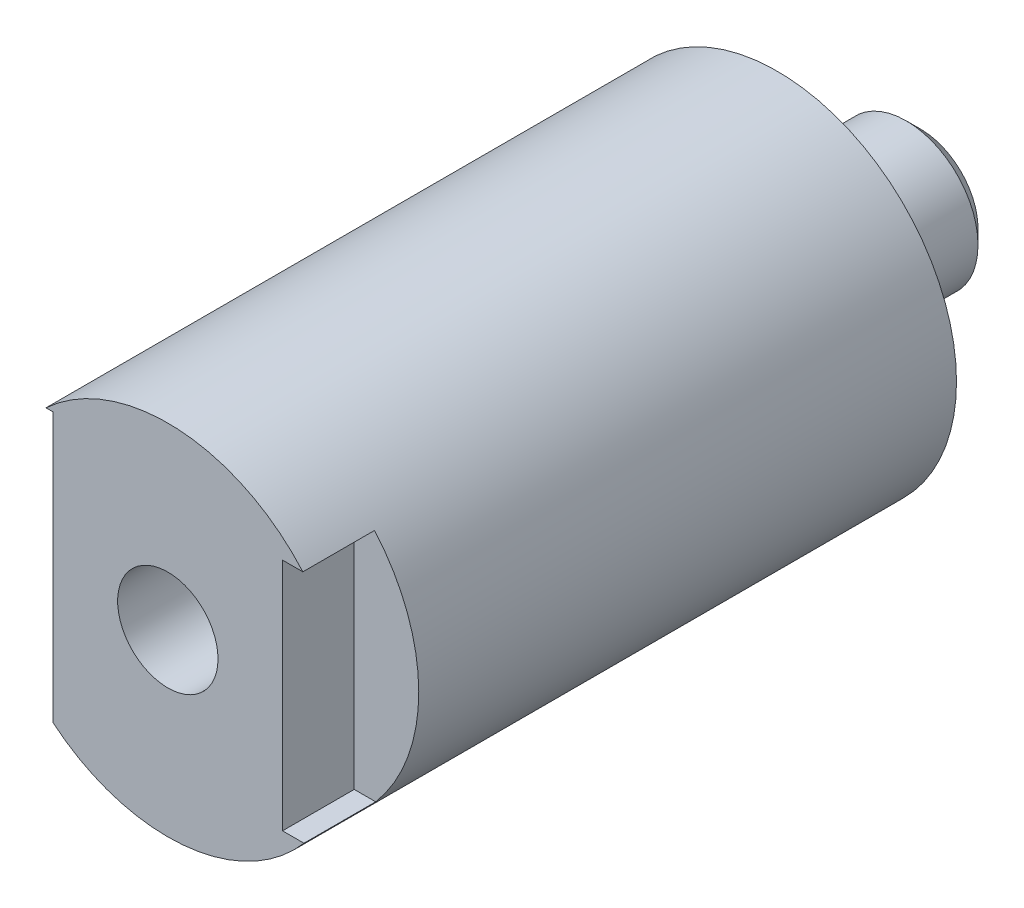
from build123d import *

# Parameters (mm, degrees)
ESQUISSE1_R                = 25
BASE_EXTRUSION_DEPTH       = 85
ESQUISSE3_W                = 12.737127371
ESQUISSE3_H                = 32.700993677
ESQUISSE3_W_2              = 12.375790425
ESQUISSE3_H_2              = 37.579042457
ENL_V_MAT_EXTRU_2_DEPTH    = 10
ESQUISSE4_R                = 10
BOSS_EXTRU_1_DEPTH         = 20
CHANFREIN1_SIZE            = 2
TROU_TARAUD_M16X2_01_D     = 14
TROU_TARAUD_M16X2_01_DEPTH = 30
TROU_TARAUD_M16X2_01_TIP   = 4.206024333


with BuildPart() as part:
    # Esquisse1 → Base-Extrusion (new body)
    with BuildSketch(Plane.XY):
        Circle(ESQUISSE1_R)
    extrude(amount=BASE_EXTRUSION_DEPTH)

    # Esquisse3 → Enl_v. mat.-Extru.2 (cut)
    with BuildSketch(Plane.XY.offset(85)):
        with Locations((22.368563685, 0.090334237)):
            Rectangle(ESQUISSE3_W, ESQUISSE3_H)
        with Locations((-22.187895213, -0.451671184)):
            Rectangle(ESQUISSE3_W_2, ESQUISSE3_H_2)
    extrude(amount=-ENL_V_MAT_EXTRU_2_DEPTH, mode=Mode.SUBTRACT)

    # Esquisse4 → Boss.-Extru.1 (add)
    with BuildSketch(Plane(origin=(0, 0, 0), x_dir=(-1, 0, 0), z_dir=(0, 0, -1))):
        with Locations(Location((0, 0, 0), (0, 0, 180))):
            Circle(ESQUISSE4_R)
    extrude(amount=BOSS_EXTRU_1_DEPTH)

    # Chanfrein1
    chanfrein1_edges = [part.edges().sort_by_distance(p)[0] for p in [
        (-10, 0, -20),
    ]]
    chamfer(chanfrein1_edges, length=CHANFREIN1_SIZE)

    # Trou taraud_ M16x2.01
    with Locations(Plane.XY.offset(85)):
        with Locations((0, 0)):
            Hole(TROU_TARAUD_M16X2_01_D / 2, depth=TROU_TARAUD_M16X2_01_DEPTH)
            with Locations((0, 0, -(TROU_TARAUD_M16X2_01_DEPTH + TROU_TARAUD_M16X2_01_TIP / 2))):  # 118° drill point
                Cone(0, TROU_TARAUD_M16X2_01_D / 2, TROU_TARAUD_M16X2_01_TIP, mode=Mode.SUBTRACT)


solid = part.part
